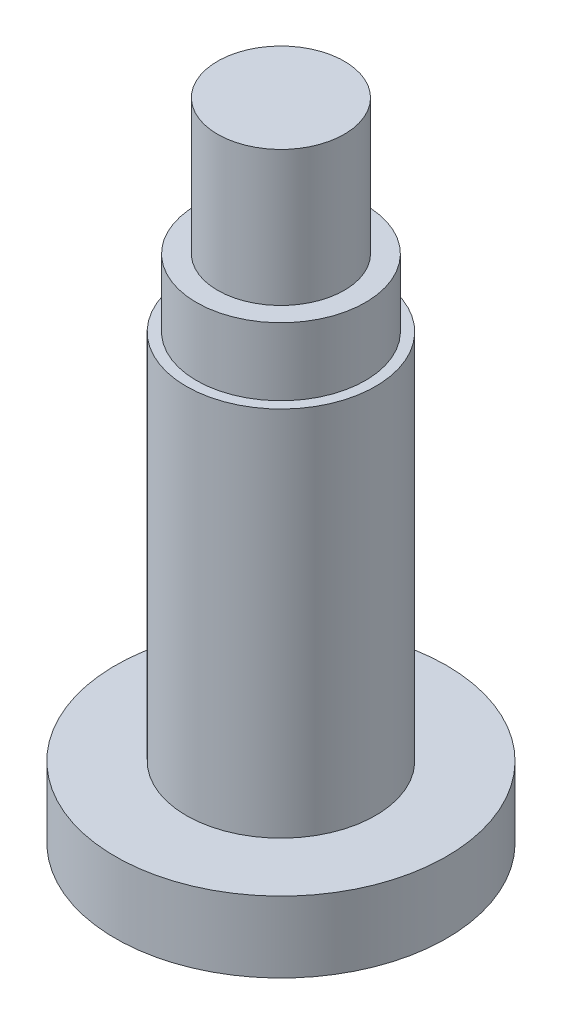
from build123d import *

# Parameters (mm, degrees)
SKETCH1_R          = 12.446
EXTRUDE1_DEPTH     = 6.604
SKETCH2_R          = 7.112
EXTRUDE2_DEPTH     = 27.94
SKETCH3_R          = 6.35
EXTRUDE3_DEPTH     = 5.08
SKETCH4_R          = 4.7625
EXTRUDE4_DEPTH     = 10.16
SKETCH5_R          = 6.5024
CUT_EXTRUDE1_DEPTH = 24.892
SKETCH6_R          = 1.27
EXTRUDE5_DEPTH     = 0.762
SKETCH7_OUTSIDE_W  = 39.086
SKETCH7_OUTSIDE_H  = 39.086
SKETCH7_OUTSIDE_R  = 9.017
CUT_EXTRUDE2_DEPTH = 1.27


with BuildPart() as part:
    # Sketch1 → Extrude1 (new body)
    with BuildSketch(Plane(origin=(0, 0, 0), x_dir=(1, 0, 0), z_dir=(0, 1, 0))):
        with Locations(Location((0, 0, 0), (0, 0, 90))):
            Circle(SKETCH1_R)
    extrude(amount=EXTRUDE1_DEPTH)

    # Sketch2 → Extrude2 (add)
    with BuildSketch(Plane(origin=(0, 6.604, 0), x_dir=(-1, 0, 0), z_dir=(0, 1, 0))):
        with Locations(Location((0, 0, 0), (0, 0, 90))):
            Circle(SKETCH2_R)
    extrude(amount=EXTRUDE2_DEPTH)

    # Sketch3 → Extrude3 (add)
    with BuildSketch(Plane(origin=(0, 34.544, 0), x_dir=(-1, 0, 0), z_dir=(0, 1, 0))):
        with Locations(Location((0, 0, 0), (0, 0, 90))):
            Circle(SKETCH3_R)
    extrude(amount=EXTRUDE3_DEPTH)

    # Sketch4 → Extrude4 (add)
    with BuildSketch(Plane(origin=(0, 39.624, 0), x_dir=(-1, 0, 0), z_dir=(0, 1, 0))):
        with Locations(Location((0, 0, 0), (0, 0, 90))):
            Circle(SKETCH4_R)
    extrude(amount=EXTRUDE4_DEPTH)

    # Sketch5 → Cut-Extrude1 (cut)
    with BuildSketch(Plane.XZ):
        with Locations(Location((0, 0, 0), (0, 0, 270))):
            Circle(SKETCH5_R)
    extrude(amount=-CUT_EXTRUDE1_DEPTH, mode=Mode.SUBTRACT)

    # Sketch6 → Extrude5 (add)
    with BuildSketch(Plane.XZ.offset(-24.892)):
        with Locations(Location((0, 0, 0), (0, 0, 90))):
            Circle(SKETCH6_R)
    extrude(amount=EXTRUDE5_DEPTH)

    # Sketch7 outside → Cut-Extrude2 (cut)
    with BuildSketch(Plane.XZ):
        Rectangle(SKETCH7_OUTSIDE_W, SKETCH7_OUTSIDE_H)
        with Locations(Location((0, 0, 0), (0, 0, 270))):
            Circle(SKETCH7_OUTSIDE_R, mode=Mode.SUBTRACT)
    extrude(amount=-CUT_EXTRUDE2_DEPTH, mode=Mode.SUBTRACT)


solid = part.part
